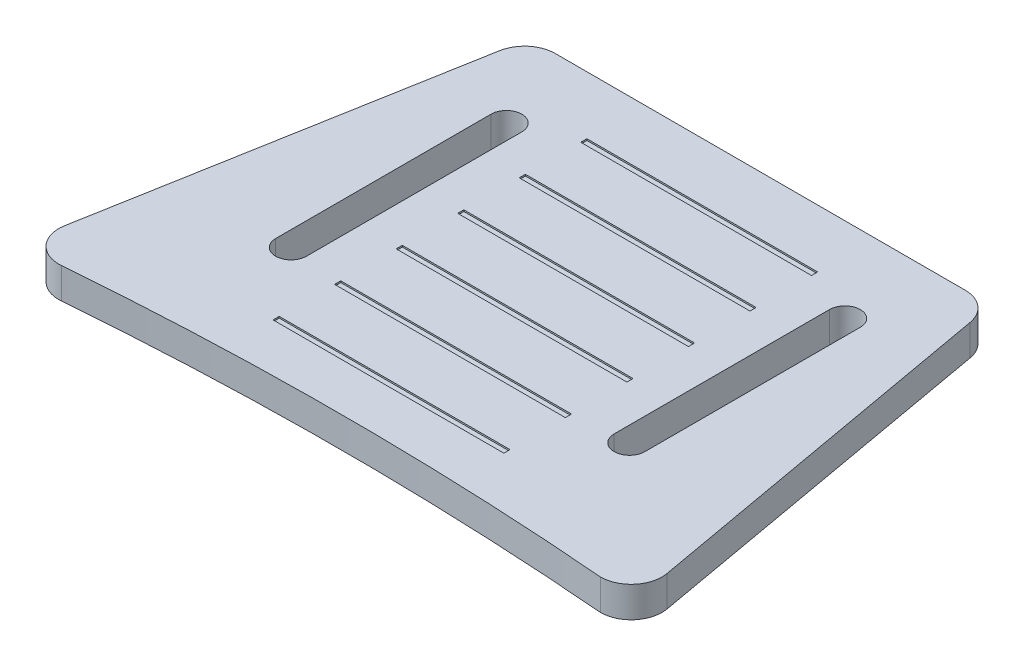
ISO-10303-21;
HEADER;
FILE_DESCRIPTION(('STEP AP214'),'2;1');
FILE_NAME('part.step','',(''),(''),'','','');
FILE_SCHEMA(('AUTOMOTIVE_DESIGN { 1 0 10303 214 1 1 1 1 }'));
ENDSEC;
DATA;
#1=APPLICATION_CONTEXT('core data for automotive mechanical design processes');
#2=APPLICATION_PROTOCOL_DEFINITION('international standard','automotive_design',2000,#1);
#3=PRODUCT_CONTEXT('',#1,'mechanical');
#4=PRODUCT('Part','Part','',(#3));
#5=PRODUCT_RELATED_PRODUCT_CATEGORY('part','',(#4));
#6=PRODUCT_DEFINITION_FORMATION('','',#4);
#7=PRODUCT_DEFINITION_CONTEXT('part definition',#1,'design');
#8=PRODUCT_DEFINITION('design','',#6,#7);
#9=PRODUCT_DEFINITION_SHAPE('','',#8);
#10=(LENGTH_UNIT() NAMED_UNIT(*) SI_UNIT(.MILLI.,.METRE.));
#11=(NAMED_UNIT(*) PLANE_ANGLE_UNIT() SI_UNIT($,.RADIAN.));
#12=(NAMED_UNIT(*) SI_UNIT($,.STERADIAN.) SOLID_ANGLE_UNIT());
#13=UNCERTAINTY_MEASURE_WITH_UNIT(LENGTH_MEASURE(1.E-05),#10,'distance_accuracy_value','');
#14=(GEOMETRIC_REPRESENTATION_CONTEXT(3) GLOBAL_UNCERTAINTY_ASSIGNED_CONTEXT((#13)) GLOBAL_UNIT_ASSIGNED_CONTEXT((#10,
#11,#12)) REPRESENTATION_CONTEXT('',''));
#15=CARTESIAN_POINT('',(0.,0.,0.));
#16=DIRECTION('',(0.,0.,1.));
#17=DIRECTION('',(1.,0.,0.));
#18=AXIS2_PLACEMENT_3D('',#15,#16,#17);
#19=CARTESIAN_POINT('',(32.6112196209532,2.,26.));
#20=DIRECTION('',(0.,-1.,0.));
#21=DIRECTION('',(0.,0.,-1.));
#22=AXIS2_PLACEMENT_3D('',#19,#20,#21);
#23=PLANE('',#22);
#24=DIRECTION('',(-1.,0.,0.));
#25=VECTOR('',#24,1.);
#26=CARTESIAN_POINT('',(7.5000000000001,2.,19.7696220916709));
#27=LINE('',#26,#25);
#28=CARTESIAN_POINT('',(22.5000000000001,2.,19.7696220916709));
#29=VERTEX_POINT('',#28);
#30=CARTESIAN_POINT('',(7.5000000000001,2.,19.7696220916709));
#31=VERTEX_POINT('',#30);
#32=EDGE_CURVE('E302',#29,#31,#27,.T.);
#33=ORIENTED_EDGE('',*,*,#32,.F.);
#34=DIRECTION('',(0.,0.,-1.));
#35=VECTOR('',#34,1.);
#36=CARTESIAN_POINT('',(22.5000000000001,2.,19.7696220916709));
#37=LINE('',#36,#35);
#38=CARTESIAN_POINT('',(22.5000000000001,2.,20.1696220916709));
#39=VERTEX_POINT('',#38);
#40=EDGE_CURVE('E316',#39,#29,#37,.T.);
#41=ORIENTED_EDGE('',*,*,#40,.F.);
#42=DIRECTION('',(1.,0.,0.));
#43=VECTOR('',#42,1.);
#44=CARTESIAN_POINT('',(7.5000000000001,2.,20.1696220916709));
#45=LINE('',#44,#43);
#46=CARTESIAN_POINT('',(7.5000000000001,2.,20.1696220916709));
#47=VERTEX_POINT('',#46);
#48=EDGE_CURVE('E326',#47,#39,#45,.T.);
#49=ORIENTED_EDGE('',*,*,#48,.F.);
#50=DIRECTION('',(0.,0.,1.));
#51=VECTOR('',#50,1.);
#52=CARTESIAN_POINT('',(7.5000000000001,2.,19.7696220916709));
#53=LINE('',#52,#51);
#54=EDGE_CURVE('E317',#31,#47,#53,.T.);
#55=ORIENTED_EDGE('',*,*,#54,.F.);
#56=EDGE_LOOP('',(#33,#41,#49,#55));
#57=FACE_BOUND('',#56,.T.);
#58=DIRECTION('',(-1.,0.,0.));
#59=VECTOR('',#58,1.);
#60=CARTESIAN_POINT('',(7.5000000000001,2.,23.7696220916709));
#61=LINE('',#60,#59);
#62=CARTESIAN_POINT('',(22.5000000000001,2.,23.7696220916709));
#63=VERTEX_POINT('',#62);
#64=CARTESIAN_POINT('',(7.5000000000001,2.,23.7696220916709));
#65=VERTEX_POINT('',#64);
#66=EDGE_CURVE('E347',#63,#65,#61,.T.);
#67=ORIENTED_EDGE('',*,*,#66,.F.);
#68=DIRECTION('',(0.,0.,-1.));
#69=VECTOR('',#68,1.);
#70=CARTESIAN_POINT('',(22.5000000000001,2.,23.7696220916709));
#71=LINE('',#70,#69);
#72=CARTESIAN_POINT('',(22.5000000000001,2.,24.1696220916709));
#73=VERTEX_POINT('',#72);
#74=EDGE_CURVE('E331',#73,#63,#71,.T.);
#75=ORIENTED_EDGE('',*,*,#74,.F.);
#76=DIRECTION('',(1.,0.,0.));
#77=VECTOR('',#76,1.);
#78=CARTESIAN_POINT('',(7.5000000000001,2.,24.1696220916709));
#79=LINE('',#78,#77);
#80=CARTESIAN_POINT('',(7.5000000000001,2.,24.1696220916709));
#81=VERTEX_POINT('',#80);
#82=EDGE_CURVE('E336',#81,#73,#79,.T.);
#83=ORIENTED_EDGE('',*,*,#82,.F.);
#84=DIRECTION('',(0.,0.,1.));
#85=VECTOR('',#84,1.);
#86=CARTESIAN_POINT('',(7.5000000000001,2.,23.7696220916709));
#87=LINE('',#86,#85);
#88=EDGE_CURVE('E350',#65,#81,#87,.T.);
#89=ORIENTED_EDGE('',*,*,#88,.F.);
#90=EDGE_LOOP('',(#67,#75,#83,#89));
#91=FACE_BOUND('',#90,.T.);
#92=CARTESIAN_POINT('',(4.,2.,5.5));
#93=DIRECTION('',(0.,1.,0.));
#94=DIRECTION('',(0.,0.,1.));
#95=AXIS2_PLACEMENT_3D('',#92,#93,#94);
#96=CIRCLE('',#95,1.);
#97=CARTESIAN_POINT('',(5.,2.,5.5));
#98=VERTEX_POINT('',#97);
#99=CARTESIAN_POINT('',(3.,2.,5.5));
#100=VERTEX_POINT('',#99);
#101=EDGE_CURVE('E395',#98,#100,#96,.T.);
#102=ORIENTED_EDGE('',*,*,#101,.F.);
#103=DIRECTION('',(0.,0.,-1.));
#104=VECTOR('',#103,1.);
#105=CARTESIAN_POINT('',(5.,2.,5.5));
#106=LINE('',#105,#104);
#107=CARTESIAN_POINT('',(5.,2.,19.5));
#108=VERTEX_POINT('',#107);
#109=EDGE_CURVE('E403',#108,#98,#106,.T.);
#110=ORIENTED_EDGE('',*,*,#109,.F.);
#111=CARTESIAN_POINT('',(4.,2.,19.5));
#112=DIRECTION('',(0.,1.,0.));
#113=DIRECTION('',(0.,0.,1.));
#114=AXIS2_PLACEMENT_3D('',#111,#112,#113);
#115=CIRCLE('',#114,0.999999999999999);
#116=CARTESIAN_POINT('',(3.,2.,19.5));
#117=VERTEX_POINT('',#116);
#118=EDGE_CURVE('E400',#117,#108,#115,.T.);
#119=ORIENTED_EDGE('',*,*,#118,.F.);
#120=DIRECTION('',(0.,0.,1.));
#121=VECTOR('',#120,1.);
#122=CARTESIAN_POINT('',(3.,2.,5.5));
#123=LINE('',#122,#121);
#124=EDGE_CURVE('E397',#100,#117,#123,.T.);
#125=ORIENTED_EDGE('',*,*,#124,.F.);
#126=EDGE_LOOP('',(#102,#110,#119,#125));
#127=FACE_BOUND('',#126,.T.);
#128=CARTESIAN_POINT('',(32.6112196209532,2.,26.));
#129=DIRECTION('',(0.,1.,0.));
#130=DIRECTION('',(0.,0.,-1.));
#131=AXIS2_PLACEMENT_3D('',#128,#129,#130);
#132=CIRCLE('',#131,2.00000000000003);
#133=CARTESIAN_POINT('',(32.6112196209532,2.,28.));
#134=VERTEX_POINT('',#133);
#135=CARTESIAN_POINT('',(34.5800747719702,2.,25.6484187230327));
#136=VERTEX_POINT('',#135);
#137=EDGE_CURVE('E426',#134,#136,#132,.T.);
#138=ORIENTED_EDGE('',*,*,#137,.T.);
#139=DIRECTION('',(-0.17579063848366,0.,-0.984427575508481));
#140=VECTOR('',#139,1.);
#141=CARTESIAN_POINT('',(30.2943604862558,2.,1.64841872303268));
#142=LINE('',#141,#140);
#143=CARTESIAN_POINT('',(30.2943604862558,2.,1.64841872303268));
#144=VERTEX_POINT('',#143);
#145=EDGE_CURVE('E429',#136,#144,#142,.T.);
#146=ORIENTED_EDGE('',*,*,#145,.T.);
#147=CARTESIAN_POINT('',(28.3255053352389,2.,2.));
#148=DIRECTION('',(0.,1.,0.));
#149=DIRECTION('',(0.,0.,-1.));
#150=AXIS2_PLACEMENT_3D('',#147,#148,#149);
#151=CIRCLE('',#150,2.);
#152=CARTESIAN_POINT('',(28.3255053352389,2.,0.));
#153=VERTEX_POINT('',#152);
#154=EDGE_CURVE('E432',#144,#153,#151,.T.);
#155=ORIENTED_EDGE('',*,*,#154,.T.);
#156=DIRECTION('',(-1.,0.,0.));
#157=VECTOR('',#156,1.);
#158=CARTESIAN_POINT('',(1.67449466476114,2.,0.));
#159=LINE('',#158,#157);
#160=CARTESIAN_POINT('',(1.67449466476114,2.,0.));
#161=VERTEX_POINT('',#160);
#162=EDGE_CURVE('E434',#153,#161,#159,.T.);
#163=ORIENTED_EDGE('',*,*,#162,.T.);
#164=CARTESIAN_POINT('',(1.67449466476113,2.,2.));
#165=DIRECTION('',(0.,1.,0.));
#166=DIRECTION('',(0.,0.,1.));
#167=AXIS2_PLACEMENT_3D('',#164,#165,#166);
#168=CIRCLE('',#167,2.);
#169=CARTESIAN_POINT('',(-0.294360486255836,2.,1.64841872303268));
#170=VERTEX_POINT('',#169);
#171=EDGE_CURVE('E436',#161,#170,#168,.T.);
#172=ORIENTED_EDGE('',*,*,#171,.T.);
#173=DIRECTION('',(-0.175790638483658,0.,0.984427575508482));
#174=VECTOR('',#173,1.);
#175=CARTESIAN_POINT('',(-4.57883865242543,2.,25.6414964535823));
#176=LINE('',#175,#174);
#177=CARTESIAN_POINT('',(-4.57883865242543,2.,25.6414964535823));
#178=VERTEX_POINT('',#177);
#179=EDGE_CURVE('E438',#170,#178,#176,.T.);
#180=ORIENTED_EDGE('',*,*,#179,.T.);
#181=CARTESIAN_POINT('',(-2.60998350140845,2.,25.9930777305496));
#182=DIRECTION('',(0.,1.,0.));
#183=DIRECTION('',(0.,0.,-1.));
#184=AXIS2_PLACEMENT_3D('',#181,#182,#183);
#185=CIRCLE('',#184,1.99999999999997);
#186=CARTESIAN_POINT('',(-2.44601134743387,2.,27.9863446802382));
#187=VERTEX_POINT('',#186);
#188=EDGE_CURVE('E440',#178,#187,#185,.T.);
#189=ORIENTED_EDGE('',*,*,#188,.T.);
#190=CARTESIAN_POINT('',(15.,2.,240.062340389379));
#191=DIRECTION('',(0.,-1.,0.));
#192=DIRECTION('',(0.,0.,-1.));
#193=AXIS2_PLACEMENT_3D('',#190,#191,#192);
#194=CIRCLE('',#193,212.792366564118);
#195=EDGE_CURVE('E442',#187,#134,#194,.T.);
#196=ORIENTED_EDGE('',*,*,#195,.T.);
#197=EDGE_LOOP('',(#138,#146,#155,#163,#172,#180,#189,#196));
#198=FACE_BOUND('',#197,.T.);
#199=CARTESIAN_POINT('',(26.,2.,5.5));
#200=DIRECTION('',(0.,1.,0.));
#201=DIRECTION('',(0.,0.,-1.));
#202=AXIS2_PLACEMENT_3D('',#199,#200,#201);
#203=CIRCLE('',#202,1.);
#204=CARTESIAN_POINT('',(27.,2.,5.5));
#205=VERTEX_POINT('',#204);
#206=CARTESIAN_POINT('',(25.,2.,5.5));
#207=VERTEX_POINT('',#206);
#208=EDGE_CURVE('E364',#205,#207,#203,.T.);
#209=ORIENTED_EDGE('',*,*,#208,.F.);
#210=DIRECTION('',(0.,0.,-1.));
#211=VECTOR('',#210,1.);
#212=CARTESIAN_POINT('',(27.,2.,5.5));
#213=LINE('',#212,#211);
#214=CARTESIAN_POINT('',(27.,2.,19.5));
#215=VERTEX_POINT('',#214);
#216=EDGE_CURVE('E372',#215,#205,#213,.T.);
#217=ORIENTED_EDGE('',*,*,#216,.F.);
#218=CARTESIAN_POINT('',(26.,2.,19.5));
#219=DIRECTION('',(0.,1.,0.));
#220=DIRECTION('',(0.,0.,-1.));
#221=AXIS2_PLACEMENT_3D('',#218,#219,#220);
#222=CIRCLE('',#221,0.999999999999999);
#223=CARTESIAN_POINT('',(25.,2.,19.5));
#224=VERTEX_POINT('',#223);
#225=EDGE_CURVE('E369',#224,#215,#222,.T.);
#226=ORIENTED_EDGE('',*,*,#225,.F.);
#227=DIRECTION('',(0.,0.,1.));
#228=VECTOR('',#227,1.);
#229=CARTESIAN_POINT('',(25.,2.,5.5));
#230=LINE('',#229,#228);
#231=EDGE_CURVE('E366',#207,#224,#230,.T.);
#232=ORIENTED_EDGE('',*,*,#231,.F.);
#233=EDGE_LOOP('',(#209,#217,#226,#232));
#234=FACE_BOUND('',#233,.T.);
#235=DIRECTION('',(0.,0.,-1.));
#236=VECTOR('',#235,1.);
#237=CARTESIAN_POINT('',(22.5000000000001,2.,15.7696220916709));
#238=LINE('',#237,#236);
#239=CARTESIAN_POINT('',(22.5000000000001,2.,16.1696220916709));
#240=VERTEX_POINT('',#239);
#241=CARTESIAN_POINT('',(22.5000000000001,2.,15.7696220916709));
#242=VERTEX_POINT('',#241);
#243=EDGE_CURVE('E483',#240,#242,#238,.T.);
#244=ORIENTED_EDGE('',*,*,#243,.F.);
#245=DIRECTION('',(1.,0.,0.));
#246=VECTOR('',#245,1.);
#247=CARTESIAN_POINT('',(7.5000000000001,2.,16.1696220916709));
#248=LINE('',#247,#246);
#249=CARTESIAN_POINT('',(7.5000000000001,2.,16.1696220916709));
#250=VERTEX_POINT('',#249);
#251=EDGE_CURVE('E485',#250,#240,#248,.T.);
#252=ORIENTED_EDGE('',*,*,#251,.F.);
#253=DIRECTION('',(0.,0.,1.));
#254=VECTOR('',#253,1.);
#255=CARTESIAN_POINT('',(7.5000000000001,2.,15.7696220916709));
#256=LINE('',#255,#254);
#257=CARTESIAN_POINT('',(7.5000000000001,2.,15.7696220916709));
#258=VERTEX_POINT('',#257);
#259=EDGE_CURVE('E488',#258,#250,#256,.T.);
#260=ORIENTED_EDGE('',*,*,#259,.F.);
#261=DIRECTION('',(-1.,0.,0.));
#262=VECTOR('',#261,1.);
#263=CARTESIAN_POINT('',(7.5000000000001,2.,15.7696220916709));
#264=LINE('',#263,#262);
#265=EDGE_CURVE('E491',#242,#258,#264,.T.);
#266=ORIENTED_EDGE('',*,*,#265,.F.);
#267=EDGE_LOOP('',(#244,#252,#260,#266));
#268=FACE_BOUND('',#267,.T.);
#269=DIRECTION('',(0.,0.,-1.));
#270=VECTOR('',#269,1.);
#271=CARTESIAN_POINT('',(22.5000000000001,2.,11.7696220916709));
#272=LINE('',#271,#270);
#273=CARTESIAN_POINT('',(22.5000000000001,2.,12.1696220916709));
#274=VERTEX_POINT('',#273);
#275=CARTESIAN_POINT('',(22.5000000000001,2.,11.7696220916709));
#276=VERTEX_POINT('',#275);
#277=EDGE_CURVE('E518',#274,#276,#272,.T.);
#278=ORIENTED_EDGE('',*,*,#277,.F.);
#279=DIRECTION('',(1.,0.,0.));
#280=VECTOR('',#279,1.);
#281=CARTESIAN_POINT('',(7.5000000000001,2.,12.1696220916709));
#282=LINE('',#281,#280);
#283=CARTESIAN_POINT('',(7.5000000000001,2.,12.1696220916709));
#284=VERTEX_POINT('',#283);
#285=EDGE_CURVE('E520',#284,#274,#282,.T.);
#286=ORIENTED_EDGE('',*,*,#285,.F.);
#287=DIRECTION('',(0.,0.,1.));
#288=VECTOR('',#287,1.);
#289=CARTESIAN_POINT('',(7.5000000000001,2.,11.7696220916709));
#290=LINE('',#289,#288);
#291=CARTESIAN_POINT('',(7.5000000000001,2.,11.7696220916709));
#292=VERTEX_POINT('',#291);
#293=EDGE_CURVE('E523',#292,#284,#290,.T.);
#294=ORIENTED_EDGE('',*,*,#293,.F.);
#295=DIRECTION('',(-1.,0.,0.));
#296=VECTOR('',#295,1.);
#297=CARTESIAN_POINT('',(7.5000000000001,2.,11.7696220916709));
#298=LINE('',#297,#296);
#299=EDGE_CURVE('E526',#276,#292,#298,.T.);
#300=ORIENTED_EDGE('',*,*,#299,.F.);
#301=EDGE_LOOP('',(#278,#286,#294,#300));
#302=FACE_BOUND('',#301,.T.);
#303=DIRECTION('',(0.,0.,-1.));
#304=VECTOR('',#303,1.);
#305=CARTESIAN_POINT('',(22.5000000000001,2.,7.76962209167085));
#306=LINE('',#305,#304);
#307=CARTESIAN_POINT('',(22.5000000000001,2.,8.16962209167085));
#308=VERTEX_POINT('',#307);
#309=CARTESIAN_POINT('',(22.5000000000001,2.,7.76962209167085));
#310=VERTEX_POINT('',#309);
#311=EDGE_CURVE('E553',#308,#310,#306,.T.);
#312=ORIENTED_EDGE('',*,*,#311,.F.);
#313=DIRECTION('',(1.,0.,0.));
#314=VECTOR('',#313,1.);
#315=CARTESIAN_POINT('',(7.5000000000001,2.,8.16962209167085));
#316=LINE('',#315,#314);
#317=CARTESIAN_POINT('',(7.5000000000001,2.,8.16962209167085));
#318=VERTEX_POINT('',#317);
#319=EDGE_CURVE('E555',#318,#308,#316,.T.);
#320=ORIENTED_EDGE('',*,*,#319,.F.);
#321=DIRECTION('',(0.,0.,1.));
#322=VECTOR('',#321,1.);
#323=CARTESIAN_POINT('',(7.5000000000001,2.,7.76962209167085));
#324=LINE('',#323,#322);
#325=CARTESIAN_POINT('',(7.5000000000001,2.,7.76962209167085));
#326=VERTEX_POINT('',#325);
#327=EDGE_CURVE('E558',#326,#318,#324,.T.);
#328=ORIENTED_EDGE('',*,*,#327,.F.);
#329=DIRECTION('',(-1.,0.,0.));
#330=VECTOR('',#329,1.);
#331=CARTESIAN_POINT('',(7.5000000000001,2.,7.76962209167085));
#332=LINE('',#331,#330);
#333=EDGE_CURVE('E561',#310,#326,#332,.T.);
#334=ORIENTED_EDGE('',*,*,#333,.F.);
#335=EDGE_LOOP('',(#312,#320,#328,#334));
#336=FACE_BOUND('',#335,.T.);
#337=DIRECTION('',(0.,0.,-1.));
#338=VECTOR('',#337,1.);
#339=CARTESIAN_POINT('',(22.5000000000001,2.,3.76962209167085));
#340=LINE('',#339,#338);
#341=CARTESIAN_POINT('',(22.5000000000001,2.,4.16962209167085));
#342=VERTEX_POINT('',#341);
#343=CARTESIAN_POINT('',(22.5000000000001,2.,3.76962209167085));
#344=VERTEX_POINT('',#343);
#345=EDGE_CURVE('E588',#342,#344,#340,.T.);
#346=ORIENTED_EDGE('',*,*,#345,.F.);
#347=DIRECTION('',(1.,0.,0.));
#348=VECTOR('',#347,1.);
#349=CARTESIAN_POINT('',(7.5000000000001,2.,4.16962209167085));
#350=LINE('',#349,#348);
#351=CARTESIAN_POINT('',(7.5000000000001,2.,4.16962209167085));
#352=VERTEX_POINT('',#351);
#353=EDGE_CURVE('E590',#352,#342,#350,.T.);
#354=ORIENTED_EDGE('',*,*,#353,.F.);
#355=DIRECTION('',(0.,0.,1.));
#356=VECTOR('',#355,1.);
#357=CARTESIAN_POINT('',(7.5000000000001,2.,3.76962209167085));
#358=LINE('',#357,#356);
#359=CARTESIAN_POINT('',(7.5000000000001,2.,3.76962209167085));
#360=VERTEX_POINT('',#359);
#361=EDGE_CURVE('E593',#360,#352,#358,.T.);
#362=ORIENTED_EDGE('',*,*,#361,.F.);
#363=DIRECTION('',(-1.,0.,0.));
#364=VECTOR('',#363,1.);
#365=CARTESIAN_POINT('',(7.5000000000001,2.,3.76962209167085));
#366=LINE('',#365,#364);
#367=EDGE_CURVE('E596',#344,#360,#366,.T.);
#368=ORIENTED_EDGE('',*,*,#367,.F.);
#369=EDGE_LOOP('',(#346,#354,#362,#368));
#370=FACE_BOUND('',#369,.T.);
#371=ADVANCED_FACE('F32',(#57,#91,#127,#198,#234,#268,#302,#336,#370),#23,.F.);
#372=CARTESIAN_POINT('',(32.6112196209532,0.,26.));
#373=DIRECTION('',(0.,-1.,0.));
#374=DIRECTION('',(0.,0.,-1.));
#375=AXIS2_PLACEMENT_3D('',#372,#373,#374);
#376=PLANE('',#375);
#377=DIRECTION('',(0.,0.,-1.));
#378=VECTOR('',#377,1.);
#379=CARTESIAN_POINT('',(5.,0.,5.5));
#380=LINE('',#379,#378);
#381=CARTESIAN_POINT('',(5.,0.,19.5));
#382=VERTEX_POINT('',#381);
#383=CARTESIAN_POINT('',(5.00000000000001,0.,5.5));
#384=VERTEX_POINT('',#383);
#385=EDGE_CURVE('E398',#382,#384,#380,.T.);
#386=ORIENTED_EDGE('',*,*,#385,.T.);
#387=CARTESIAN_POINT('',(4.,0.,5.5));
#388=DIRECTION('',(0.,1.,0.));
#389=DIRECTION('',(0.,0.,1.));
#390=AXIS2_PLACEMENT_3D('',#387,#388,#389);
#391=CIRCLE('',#390,1.);
#392=CARTESIAN_POINT('',(3.,0.,5.5));
#393=VERTEX_POINT('',#392);
#394=EDGE_CURVE('E394',#384,#393,#391,.T.);
#395=ORIENTED_EDGE('',*,*,#394,.T.);
#396=DIRECTION('',(0.,0.,1.));
#397=VECTOR('',#396,1.);
#398=CARTESIAN_POINT('',(3.,0.,5.5));
#399=LINE('',#398,#397);
#400=CARTESIAN_POINT('',(3.,0.,19.5));
#401=VERTEX_POINT('',#400);
#402=EDGE_CURVE('E408',#393,#401,#399,.T.);
#403=ORIENTED_EDGE('',*,*,#402,.T.);
#404=CARTESIAN_POINT('',(4.,0.,19.5));
#405=DIRECTION('',(0.,1.,0.));
#406=DIRECTION('',(0.,0.,1.));
#407=AXIS2_PLACEMENT_3D('',#404,#405,#406);
#408=CIRCLE('',#407,0.999999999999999);
#409=EDGE_CURVE('E411',#401,#382,#408,.T.);
#410=ORIENTED_EDGE('',*,*,#409,.T.);
#411=EDGE_LOOP('',(#386,#395,#403,#410));
#412=FACE_BOUND('',#411,.T.);
#413=CARTESIAN_POINT('',(32.6112196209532,0.,26.));
#414=DIRECTION('',(0.,1.,0.));
#415=DIRECTION('',(0.,0.,-1.));
#416=AXIS2_PLACEMENT_3D('',#413,#414,#415);
#417=CIRCLE('',#416,2.00000000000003);
#418=CARTESIAN_POINT('',(32.6112196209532,0.,28.));
#419=VERTEX_POINT('',#418);
#420=CARTESIAN_POINT('',(34.5800747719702,0.,25.6484187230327));
#421=VERTEX_POINT('',#420);
#422=EDGE_CURVE('E425',#419,#421,#417,.T.);
#423=ORIENTED_EDGE('',*,*,#422,.F.);
#424=CARTESIAN_POINT('',(15.,0.,240.062340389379));
#425=DIRECTION('',(0.,-1.,0.));
#426=DIRECTION('',(0.,0.,-1.));
#427=AXIS2_PLACEMENT_3D('',#424,#425,#426);
#428=CIRCLE('',#427,212.792366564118);
#429=CARTESIAN_POINT('',(-2.44601134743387,0.,27.9863446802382));
#430=VERTEX_POINT('',#429);
#431=EDGE_CURVE('E430',#430,#419,#428,.T.);
#432=ORIENTED_EDGE('',*,*,#431,.F.);
#433=CARTESIAN_POINT('',(-2.60998350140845,0.,25.9930777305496));
#434=DIRECTION('',(0.,1.,0.));
#435=DIRECTION('',(0.,0.,-1.));
#436=AXIS2_PLACEMENT_3D('',#433,#434,#435);
#437=CIRCLE('',#436,1.99999999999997);
#438=CARTESIAN_POINT('',(-4.57883865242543,0.,25.6414964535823));
#439=VERTEX_POINT('',#438);
#440=EDGE_CURVE('E457',#439,#430,#437,.T.);
#441=ORIENTED_EDGE('',*,*,#440,.F.);
#442=DIRECTION('',(-0.175790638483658,0.,0.984427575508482));
#443=VECTOR('',#442,1.);
#444=CARTESIAN_POINT('',(-4.57883865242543,0.,25.6414964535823));
#445=LINE('',#444,#443);
#446=CARTESIAN_POINT('',(-0.294360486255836,0.,1.64841872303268));
#447=VERTEX_POINT('',#446);
#448=EDGE_CURVE('E455',#447,#439,#445,.T.);
#449=ORIENTED_EDGE('',*,*,#448,.F.);
#450=CARTESIAN_POINT('',(1.67449466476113,0.,2.));
#451=DIRECTION('',(0.,1.,0.));
#452=DIRECTION('',(0.,0.,1.));
#453=AXIS2_PLACEMENT_3D('',#450,#451,#452);
#454=CIRCLE('',#453,2.);
#455=CARTESIAN_POINT('',(1.67449466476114,0.,0.));
#456=VERTEX_POINT('',#455);
#457=EDGE_CURVE('E453',#456,#447,#454,.T.);
#458=ORIENTED_EDGE('',*,*,#457,.F.);
#459=DIRECTION('',(-1.,0.,0.));
#460=VECTOR('',#459,1.);
#461=CARTESIAN_POINT('',(1.67449466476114,0.,0.));
#462=LINE('',#461,#460);
#463=CARTESIAN_POINT('',(28.3255053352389,0.,0.));
#464=VERTEX_POINT('',#463);
#465=EDGE_CURVE('E451',#464,#456,#462,.T.);
#466=ORIENTED_EDGE('',*,*,#465,.F.);
#467=CARTESIAN_POINT('',(28.3255053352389,0.,2.));
#468=DIRECTION('',(0.,1.,0.));
#469=DIRECTION('',(0.,0.,-1.));
#470=AXIS2_PLACEMENT_3D('',#467,#468,#469);
#471=CIRCLE('',#470,2.);
#472=CARTESIAN_POINT('',(30.2943604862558,0.,1.64841872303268));
#473=VERTEX_POINT('',#472);
#474=EDGE_CURVE('E449',#473,#464,#471,.T.);
#475=ORIENTED_EDGE('',*,*,#474,.F.);
#476=DIRECTION('',(-0.17579063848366,0.,-0.984427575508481));
#477=VECTOR('',#476,1.);
#478=CARTESIAN_POINT('',(30.2943604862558,0.,1.64841872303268));
#479=LINE('',#478,#477);
#480=EDGE_CURVE('E447',#421,#473,#479,.T.);
#481=ORIENTED_EDGE('',*,*,#480,.F.);
#482=EDGE_LOOP('',(#423,#432,#441,#449,#458,#466,#475,#481));
#483=FACE_BOUND('',#482,.T.);
#484=DIRECTION('',(0.,0.,-1.));
#485=VECTOR('',#484,1.);
#486=CARTESIAN_POINT('',(27.,0.,5.5));
#487=LINE('',#486,#485);
#488=CARTESIAN_POINT('',(27.,0.,19.5));
#489=VERTEX_POINT('',#488);
#490=CARTESIAN_POINT('',(27.,0.,5.5));
#491=VERTEX_POINT('',#490);
#492=EDGE_CURVE('E367',#489,#491,#487,.T.);
#493=ORIENTED_EDGE('',*,*,#492,.T.);
#494=CARTESIAN_POINT('',(26.,0.,5.5));
#495=DIRECTION('',(0.,1.,0.));
#496=DIRECTION('',(0.,0.,-1.));
#497=AXIS2_PLACEMENT_3D('',#494,#495,#496);
#498=CIRCLE('',#497,1.);
#499=CARTESIAN_POINT('',(25.,0.,5.5));
#500=VERTEX_POINT('',#499);
#501=EDGE_CURVE('E357',#491,#500,#498,.T.);
#502=ORIENTED_EDGE('',*,*,#501,.T.);
#503=DIRECTION('',(0.,0.,1.));
#504=VECTOR('',#503,1.);
#505=CARTESIAN_POINT('',(25.,0.,5.5));
#506=LINE('',#505,#504);
#507=CARTESIAN_POINT('',(25.,0.,19.5));
#508=VERTEX_POINT('',#507);
#509=EDGE_CURVE('E377',#500,#508,#506,.T.);
#510=ORIENTED_EDGE('',*,*,#509,.T.);
#511=CARTESIAN_POINT('',(26.,0.,19.5));
#512=DIRECTION('',(0.,1.,0.));
#513=DIRECTION('',(0.,0.,-1.));
#514=AXIS2_PLACEMENT_3D('',#511,#512,#513);
#515=CIRCLE('',#514,0.999999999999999);
#516=EDGE_CURVE('E380',#508,#489,#515,.T.);
#517=ORIENTED_EDGE('',*,*,#516,.T.);
#518=EDGE_LOOP('',(#493,#502,#510,#517));
#519=FACE_BOUND('',#518,.T.);
#520=ADVANCED_FACE('F622',(#412,#483,#519),#376,.T.);
#521=CARTESIAN_POINT('',(32.6112196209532,2.,26.));
#522=DIRECTION('',(0.,-1.,0.));
#523=DIRECTION('',(0.,0.,-1.));
#524=AXIS2_PLACEMENT_3D('',#521,#522,#523);
#525=CYLINDRICAL_SURFACE('',#524,2.00000000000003);
#526=ORIENTED_EDGE('',*,*,#422,.T.);
#527=DIRECTION('',(0.,-1.,0.));
#528=VECTOR('',#527,1.);
#529=CARTESIAN_POINT('',(34.5800747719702,2.,25.6484187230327));
#530=LINE('',#529,#528);
#531=EDGE_CURVE('E480',#136,#421,#530,.T.);
#532=ORIENTED_EDGE('',*,*,#531,.F.);
#533=ORIENTED_EDGE('',*,*,#137,.F.);
#534=DIRECTION('',(0.,-1.,0.));
#535=VECTOR('',#534,1.);
#536=CARTESIAN_POINT('',(32.6112196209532,2.,28.));
#537=LINE('',#536,#535);
#538=EDGE_CURVE('E444',#134,#419,#537,.T.);
#539=ORIENTED_EDGE('',*,*,#538,.T.);
#540=EDGE_LOOP('',(#526,#532,#533,#539));
#541=FACE_BOUND('',#540,.T.);
#542=ADVANCED_FACE('F628',(#541),#525,.T.);
#543=CARTESIAN_POINT('',(30.2943604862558,2.,1.64841872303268));
#544=DIRECTION('',(-0.984427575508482,0.,0.17579063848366));
#545=DIRECTION('',(0.17579063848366,0.,0.984427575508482));
#546=AXIS2_PLACEMENT_3D('',#543,#544,#545);
#547=PLANE('',#546);
#548=ORIENTED_EDGE('',*,*,#480,.T.);
#549=DIRECTION('',(0.,-1.,0.));
#550=VECTOR('',#549,1.);
#551=CARTESIAN_POINT('',(30.2943604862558,2.,1.64841872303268));
#552=LINE('',#551,#550);
#553=EDGE_CURVE('E477',#144,#473,#552,.T.);
#554=ORIENTED_EDGE('',*,*,#553,.F.);
#555=ORIENTED_EDGE('',*,*,#145,.F.);
#556=ORIENTED_EDGE('',*,*,#531,.T.);
#557=EDGE_LOOP('',(#548,#554,#555,#556));
#558=FACE_BOUND('',#557,.T.);
#559=ADVANCED_FACE('F659',(#558),#547,.F.);
#560=CARTESIAN_POINT('',(28.3255053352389,2.,2.));
#561=DIRECTION('',(0.,-1.,0.));
#562=DIRECTION('',(0.,0.,-1.));
#563=AXIS2_PLACEMENT_3D('',#560,#561,#562);
#564=CYLINDRICAL_SURFACE('',#563,2.);
#565=ORIENTED_EDGE('',*,*,#474,.T.);
#566=DIRECTION('',(0.,-1.,0.));
#567=VECTOR('',#566,1.);
#568=CARTESIAN_POINT('',(28.3255053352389,2.,0.));
#569=LINE('',#568,#567);
#570=EDGE_CURVE('E474',#153,#464,#569,.T.);
#571=ORIENTED_EDGE('',*,*,#570,.F.);
#572=ORIENTED_EDGE('',*,*,#154,.F.);
#573=ORIENTED_EDGE('',*,*,#553,.T.);
#574=EDGE_LOOP('',(#565,#571,#572,#573));
#575=FACE_BOUND('',#574,.T.);
#576=ADVANCED_FACE('F655',(#575),#564,.T.);
#577=CARTESIAN_POINT('',(1.67449466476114,2.,0.));
#578=DIRECTION('',(0.,0.,1.));
#579=DIRECTION('',(1.,0.,0.));
#580=AXIS2_PLACEMENT_3D('',#577,#578,#579);
#581=PLANE('',#580);
#582=ORIENTED_EDGE('',*,*,#465,.T.);
#583=DIRECTION('',(0.,-1.,0.));
#584=VECTOR('',#583,1.);
#585=CARTESIAN_POINT('',(1.67449466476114,2.,0.));
#586=LINE('',#585,#584);
#587=EDGE_CURVE('E471',#161,#456,#586,.T.);
#588=ORIENTED_EDGE('',*,*,#587,.F.);
#589=ORIENTED_EDGE('',*,*,#162,.F.);
#590=ORIENTED_EDGE('',*,*,#570,.T.);
#591=EDGE_LOOP('',(#582,#588,#589,#590));
#592=FACE_BOUND('',#591,.T.);
#593=ADVANCED_FACE('F651',(#592),#581,.F.);
#594=CARTESIAN_POINT('',(1.67449466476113,2.,2.));
#595=DIRECTION('',(0.,-1.,0.));
#596=DIRECTION('',(0.,0.,-1.));
#597=AXIS2_PLACEMENT_3D('',#594,#595,#596);
#598=CYLINDRICAL_SURFACE('',#597,2.);
#599=ORIENTED_EDGE('',*,*,#457,.T.);
#600=DIRECTION('',(0.,-1.,0.));
#601=VECTOR('',#600,1.);
#602=CARTESIAN_POINT('',(-0.294360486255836,2.,1.64841872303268));
#603=LINE('',#602,#601);
#604=EDGE_CURVE('E468',#170,#447,#603,.T.);
#605=ORIENTED_EDGE('',*,*,#604,.F.);
#606=ORIENTED_EDGE('',*,*,#171,.F.);
#607=ORIENTED_EDGE('',*,*,#587,.T.);
#608=EDGE_LOOP('',(#599,#605,#606,#607));
#609=FACE_BOUND('',#608,.T.);
#610=ADVANCED_FACE('F647',(#609),#598,.T.);
#611=CARTESIAN_POINT('',(-4.57883865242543,2.,25.6414964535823));
#612=DIRECTION('',(0.984427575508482,0.,0.175790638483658));
#613=DIRECTION('',(0.175790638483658,0.,-0.984427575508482));
#614=AXIS2_PLACEMENT_3D('',#611,#612,#613);
#615=PLANE('',#614);
#616=ORIENTED_EDGE('',*,*,#448,.T.);
#617=DIRECTION('',(0.,-1.,0.));
#618=VECTOR('',#617,1.);
#619=CARTESIAN_POINT('',(-4.57883865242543,2.,25.6414964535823));
#620=LINE('',#619,#618);
#621=EDGE_CURVE('E465',#178,#439,#620,.T.);
#622=ORIENTED_EDGE('',*,*,#621,.F.);
#623=ORIENTED_EDGE('',*,*,#179,.F.);
#624=ORIENTED_EDGE('',*,*,#604,.T.);
#625=EDGE_LOOP('',(#616,#622,#623,#624));
#626=FACE_BOUND('',#625,.T.);
#627=ADVANCED_FACE('F643',(#626),#615,.F.);
#628=CARTESIAN_POINT('',(-2.60998350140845,2.,25.9930777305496));
#629=DIRECTION('',(0.,-1.,0.));
#630=DIRECTION('',(0.,0.,-1.));
#631=AXIS2_PLACEMENT_3D('',#628,#629,#630);
#632=CYLINDRICAL_SURFACE('',#631,1.99999999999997);
#633=ORIENTED_EDGE('',*,*,#440,.T.);
#634=DIRECTION('',(0.,-1.,0.));
#635=VECTOR('',#634,1.);
#636=CARTESIAN_POINT('',(-2.44601134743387,2.,27.9863446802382));
#637=LINE('',#636,#635);
#638=EDGE_CURVE('E462',#187,#430,#637,.T.);
#639=ORIENTED_EDGE('',*,*,#638,.F.);
#640=ORIENTED_EDGE('',*,*,#188,.F.);
#641=ORIENTED_EDGE('',*,*,#621,.T.);
#642=EDGE_LOOP('',(#633,#639,#640,#641));
#643=FACE_BOUND('',#642,.T.);
#644=ADVANCED_FACE('F639',(#643),#632,.T.);
#645=CARTESIAN_POINT('',(15.,2.,240.062340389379));
#646=DIRECTION('',(0.,-1.,0.));
#647=DIRECTION('',(0.,0.,-1.));
#648=AXIS2_PLACEMENT_3D('',#645,#646,#647);
#649=CYLINDRICAL_SURFACE('',#648,212.792366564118);
#650=ORIENTED_EDGE('',*,*,#431,.T.);
#651=ORIENTED_EDGE('',*,*,#538,.F.);
#652=ORIENTED_EDGE('',*,*,#195,.F.);
#653=ORIENTED_EDGE('',*,*,#638,.T.);
#654=EDGE_LOOP('',(#650,#651,#652,#653));
#655=FACE_BOUND('',#654,.T.);
#656=ADVANCED_FACE('F636',(#655),#649,.F.);
#657=CARTESIAN_POINT('',(4.,2.,5.5));
#658=DIRECTION('',(0.,-1.,0.));
#659=DIRECTION('',(0.,0.,-1.));
#660=AXIS2_PLACEMENT_3D('',#657,#658,#659);
#661=CYLINDRICAL_SURFACE('',#660,1.);
#662=ORIENTED_EDGE('',*,*,#394,.F.);
#663=DIRECTION('',(0.,-1.,0.));
#664=VECTOR('',#663,1.);
#665=CARTESIAN_POINT('',(5.,2.,5.5));
#666=LINE('',#665,#664);
#667=EDGE_CURVE('E405',#98,#384,#666,.T.);
#668=ORIENTED_EDGE('',*,*,#667,.F.);
#669=ORIENTED_EDGE('',*,*,#101,.T.);
#670=DIRECTION('',(0.,-1.,0.));
#671=VECTOR('',#670,1.);
#672=CARTESIAN_POINT('',(3.,2.,5.5));
#673=LINE('',#672,#671);
#674=EDGE_CURVE('E422',#100,#393,#673,.T.);
#675=ORIENTED_EDGE('',*,*,#674,.T.);
#676=EDGE_LOOP('',(#662,#668,#669,#675));
#677=FACE_BOUND('',#676,.T.);
#678=ADVANCED_FACE('F633',(#677),#661,.F.);
#679=CARTESIAN_POINT('',(3.,2.,5.5));
#680=DIRECTION('',(1.,0.,0.));
#681=DIRECTION('',(0.,0.,-1.));
#682=AXIS2_PLACEMENT_3D('',#679,#680,#681);
#683=PLANE('',#682);
#684=ORIENTED_EDGE('',*,*,#402,.F.);
#685=ORIENTED_EDGE('',*,*,#674,.F.);
#686=ORIENTED_EDGE('',*,*,#124,.T.);
#687=DIRECTION('',(0.,-1.,0.));
#688=VECTOR('',#687,1.);
#689=CARTESIAN_POINT('',(3.,2.,19.5));
#690=LINE('',#689,#688);
#691=EDGE_CURVE('E420',#117,#401,#690,.T.);
#692=ORIENTED_EDGE('',*,*,#691,.T.);
#693=EDGE_LOOP('',(#684,#685,#686,#692));
#694=FACE_BOUND('',#693,.T.);
#695=ADVANCED_FACE('F919',(#694),#683,.T.);
#696=CARTESIAN_POINT('',(4.,2.,19.5));
#697=DIRECTION('',(0.,-1.,0.));
#698=DIRECTION('',(0.,0.,-1.));
#699=AXIS2_PLACEMENT_3D('',#696,#697,#698);
#700=CYLINDRICAL_SURFACE('',#699,0.999999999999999);
#701=ORIENTED_EDGE('',*,*,#409,.F.);
#702=ORIENTED_EDGE('',*,*,#691,.F.);
#703=ORIENTED_EDGE('',*,*,#118,.T.);
#704=DIRECTION('',(0.,-1.,0.));
#705=VECTOR('',#704,1.);
#706=CARTESIAN_POINT('',(5.,2.,19.5));
#707=LINE('',#706,#705);
#708=EDGE_CURVE('E418',#108,#382,#707,.T.);
#709=ORIENTED_EDGE('',*,*,#708,.T.);
#710=EDGE_LOOP('',(#701,#702,#703,#709));
#711=FACE_BOUND('',#710,.T.);
#712=ADVANCED_FACE('F911',(#711),#700,.F.);
#713=CARTESIAN_POINT('',(5.,2.,5.5));
#714=DIRECTION('',(-1.,0.,0.));
#715=DIRECTION('',(0.,0.,1.));
#716=AXIS2_PLACEMENT_3D('',#713,#714,#715);
#717=PLANE('',#716);
#718=ORIENTED_EDGE('',*,*,#385,.F.);
#719=ORIENTED_EDGE('',*,*,#708,.F.);
#720=ORIENTED_EDGE('',*,*,#109,.T.);
#721=ORIENTED_EDGE('',*,*,#667,.T.);
#722=EDGE_LOOP('',(#718,#719,#720,#721));
#723=FACE_BOUND('',#722,.T.);
#724=ADVANCED_FACE('F903',(#723),#717,.T.);
#725=CARTESIAN_POINT('',(26.,2.,5.5));
#726=DIRECTION('',(0.,-1.,0.));
#727=DIRECTION('',(0.,0.,-1.));
#728=AXIS2_PLACEMENT_3D('',#725,#726,#727);
#729=CYLINDRICAL_SURFACE('',#728,1.);
#730=ORIENTED_EDGE('',*,*,#501,.F.);
#731=DIRECTION('',(0.,-1.,0.));
#732=VECTOR('',#731,1.);
#733=CARTESIAN_POINT('',(27.,2.,5.5));
#734=LINE('',#733,#732);
#735=EDGE_CURVE('E374',#205,#491,#734,.T.);
#736=ORIENTED_EDGE('',*,*,#735,.F.);
#737=ORIENTED_EDGE('',*,*,#208,.T.);
#738=DIRECTION('',(0.,-1.,0.));
#739=VECTOR('',#738,1.);
#740=CARTESIAN_POINT('',(25.,2.,5.5));
#741=LINE('',#740,#739);
#742=EDGE_CURVE('E391',#207,#500,#741,.T.);
#743=ORIENTED_EDGE('',*,*,#742,.T.);
#744=EDGE_LOOP('',(#730,#736,#737,#743));
#745=FACE_BOUND('',#744,.T.);
#746=ADVANCED_FACE('F895',(#745),#729,.F.);
#747=CARTESIAN_POINT('',(25.,2.,5.5));
#748=DIRECTION('',(1.,0.,0.));
#749=DIRECTION('',(0.,0.,-1.));
#750=AXIS2_PLACEMENT_3D('',#747,#748,#749);
#751=PLANE('',#750);
#752=ORIENTED_EDGE('',*,*,#509,.F.);
#753=ORIENTED_EDGE('',*,*,#742,.F.);
#754=ORIENTED_EDGE('',*,*,#231,.T.);
#755=DIRECTION('',(0.,-1.,0.));
#756=VECTOR('',#755,1.);
#757=CARTESIAN_POINT('',(25.,2.,19.5));
#758=LINE('',#757,#756);
#759=EDGE_CURVE('E389',#224,#508,#758,.T.);
#760=ORIENTED_EDGE('',*,*,#759,.T.);
#761=EDGE_LOOP('',(#752,#753,#754,#760));
#762=FACE_BOUND('',#761,.T.);
#763=ADVANCED_FACE('F887',(#762),#751,.T.);
#764=CARTESIAN_POINT('',(26.,2.,19.5));
#765=DIRECTION('',(0.,-1.,0.));
#766=DIRECTION('',(0.,0.,-1.));
#767=AXIS2_PLACEMENT_3D('',#764,#765,#766);
#768=CYLINDRICAL_SURFACE('',#767,0.999999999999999);
#769=ORIENTED_EDGE('',*,*,#516,.F.);
#770=ORIENTED_EDGE('',*,*,#759,.F.);
#771=ORIENTED_EDGE('',*,*,#225,.T.);
#772=DIRECTION('',(0.,-1.,0.));
#773=VECTOR('',#772,1.);
#774=CARTESIAN_POINT('',(27.,2.,19.5));
#775=LINE('',#774,#773);
#776=EDGE_CURVE('E387',#215,#489,#775,.T.);
#777=ORIENTED_EDGE('',*,*,#776,.T.);
#778=EDGE_LOOP('',(#769,#770,#771,#777));
#779=FACE_BOUND('',#778,.T.);
#780=ADVANCED_FACE('F879',(#779),#768,.F.);
#781=CARTESIAN_POINT('',(27.,2.,5.5));
#782=DIRECTION('',(-1.,0.,0.));
#783=DIRECTION('',(0.,0.,1.));
#784=AXIS2_PLACEMENT_3D('',#781,#782,#783);
#785=PLANE('',#784);
#786=ORIENTED_EDGE('',*,*,#492,.F.);
#787=ORIENTED_EDGE('',*,*,#776,.F.);
#788=ORIENTED_EDGE('',*,*,#216,.T.);
#789=ORIENTED_EDGE('',*,*,#735,.T.);
#790=EDGE_LOOP('',(#786,#787,#788,#789));
#791=FACE_BOUND('',#790,.T.);
#792=ADVANCED_FACE('F871',(#791),#785,.T.);
#793=CARTESIAN_POINT('',(22.5000000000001,1.9,23.7696220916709));
#794=DIRECTION('',(1.,0.,0.));
#795=DIRECTION('',(0.,0.,-1.));
#796=AXIS2_PLACEMENT_3D('',#793,#794,#795);
#797=PLANE('',#796);
#798=ORIENTED_EDGE('',*,*,#74,.T.);
#799=DIRECTION('',(0.,1.,0.));
#800=VECTOR('',#799,1.);
#801=CARTESIAN_POINT('',(22.5000000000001,1.9,23.7696220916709));
#802=LINE('',#801,#800);
#803=CARTESIAN_POINT('',(22.5000000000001,1.9,23.7696220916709));
#804=VERTEX_POINT('',#803);
#805=EDGE_CURVE('E345',#804,#63,#802,.T.);
#806=ORIENTED_EDGE('',*,*,#805,.F.);
#807=DIRECTION('',(0.,0.,-1.));
#808=VECTOR('',#807,1.);
#809=CARTESIAN_POINT('',(22.5000000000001,1.9,23.7696220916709));
#810=LINE('',#809,#808);
#811=CARTESIAN_POINT('',(22.5000000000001,1.9,24.1696220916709));
#812=VERTEX_POINT('',#811);
#813=EDGE_CURVE('E332',#812,#804,#810,.T.);
#814=ORIENTED_EDGE('',*,*,#813,.F.);
#815=DIRECTION('',(0.,1.,0.));
#816=VECTOR('',#815,1.);
#817=CARTESIAN_POINT('',(22.5000000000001,1.9,24.1696220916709));
#818=LINE('',#817,#816);
#819=EDGE_CURVE('E355',#812,#73,#818,.T.);
#820=ORIENTED_EDGE('',*,*,#819,.T.);
#821=EDGE_LOOP('',(#798,#806,#814,#820));
#822=FACE_BOUND('',#821,.T.);
#823=ADVANCED_FACE('F863',(#822),#797,.F.);
#824=CARTESIAN_POINT('',(7.5000000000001,1.9,24.1696220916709));
#825=DIRECTION('',(0.,0.,1.));
#826=DIRECTION('',(1.,0.,0.));
#827=AXIS2_PLACEMENT_3D('',#824,#825,#826);
#828=PLANE('',#827);
#829=ORIENTED_EDGE('',*,*,#82,.T.);
#830=ORIENTED_EDGE('',*,*,#819,.F.);
#831=DIRECTION('',(1.,0.,0.));
#832=VECTOR('',#831,1.);
#833=CARTESIAN_POINT('',(7.5000000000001,1.9,24.1696220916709));
#834=LINE('',#833,#832);
#835=CARTESIAN_POINT('',(7.5000000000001,1.9,24.1696220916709));
#836=VERTEX_POINT('',#835);
#837=EDGE_CURVE('E342',#836,#812,#834,.T.);
#838=ORIENTED_EDGE('',*,*,#837,.F.);
#839=DIRECTION('',(0.,1.,0.));
#840=VECTOR('',#839,1.);
#841=CARTESIAN_POINT('',(7.5000000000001,1.9,24.1696220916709));
#842=LINE('',#841,#840);
#843=EDGE_CURVE('E358',#836,#81,#842,.T.);
#844=ORIENTED_EDGE('',*,*,#843,.T.);
#845=EDGE_LOOP('',(#829,#830,#838,#844));
#846=FACE_BOUND('',#845,.T.);
#847=ADVANCED_FACE('F855',(#846),#828,.F.);
#848=CARTESIAN_POINT('',(7.5000000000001,1.9,23.7696220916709));
#849=DIRECTION('',(-1.,0.,0.));
#850=DIRECTION('',(0.,0.,1.));
#851=AXIS2_PLACEMENT_3D('',#848,#849,#850);
#852=PLANE('',#851);
#853=ORIENTED_EDGE('',*,*,#88,.T.);
#854=ORIENTED_EDGE('',*,*,#843,.F.);
#855=DIRECTION('',(0.,0.,1.));
#856=VECTOR('',#855,1.);
#857=CARTESIAN_POINT('',(7.5000000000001,1.9,23.7696220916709));
#858=LINE('',#857,#856);
#859=CARTESIAN_POINT('',(7.5000000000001,1.9,23.7696220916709));
#860=VERTEX_POINT('',#859);
#861=EDGE_CURVE('E339',#860,#836,#858,.T.);
#862=ORIENTED_EDGE('',*,*,#861,.F.);
#863=DIRECTION('',(0.,1.,0.));
#864=VECTOR('',#863,1.);
#865=CARTESIAN_POINT('',(7.5000000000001,1.9,23.7696220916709));
#866=LINE('',#865,#864);
#867=EDGE_CURVE('E360',#860,#65,#866,.T.);
#868=ORIENTED_EDGE('',*,*,#867,.T.);
#869=EDGE_LOOP('',(#853,#854,#862,#868));
#870=FACE_BOUND('',#869,.T.);
#871=ADVANCED_FACE('F847',(#870),#852,.F.);
#872=CARTESIAN_POINT('',(7.5000000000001,1.9,23.7696220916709));
#873=DIRECTION('',(0.,0.,-1.));
#874=DIRECTION('',(-1.,0.,0.));
#875=AXIS2_PLACEMENT_3D('',#872,#873,#874);
#876=PLANE('',#875);
#877=ORIENTED_EDGE('',*,*,#66,.T.);
#878=ORIENTED_EDGE('',*,*,#867,.F.);
#879=DIRECTION('',(-1.,0.,0.));
#880=VECTOR('',#879,1.);
#881=CARTESIAN_POINT('',(7.5000000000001,1.9,23.7696220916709));
#882=LINE('',#881,#880);
#883=EDGE_CURVE('E335',#804,#860,#882,.T.);
#884=ORIENTED_EDGE('',*,*,#883,.F.);
#885=ORIENTED_EDGE('',*,*,#805,.T.);
#886=EDGE_LOOP('',(#877,#878,#884,#885));
#887=FACE_BOUND('',#886,.T.);
#888=ADVANCED_FACE('F839',(#887),#876,.F.);
#889=CARTESIAN_POINT('',(0.,1.9,0.));
#890=DIRECTION('',(0.,1.,0.));
#891=DIRECTION('',(0.,0.,1.));
#892=AXIS2_PLACEMENT_3D('',#889,#890,#891);
#893=PLANE('',#892);
#894=ORIENTED_EDGE('',*,*,#813,.T.);
#895=ORIENTED_EDGE('',*,*,#883,.T.);
#896=ORIENTED_EDGE('',*,*,#861,.T.);
#897=ORIENTED_EDGE('',*,*,#837,.T.);
#898=EDGE_LOOP('',(#894,#895,#896,#897));
#899=FACE_BOUND('',#898,.T.);
#900=ADVANCED_FACE('F832',(#899),#893,.T.);
#901=CARTESIAN_POINT('',(22.5000000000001,1.9,19.7696220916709));
#902=DIRECTION('',(1.,0.,0.));
#903=DIRECTION('',(0.,0.,-1.));
#904=AXIS2_PLACEMENT_3D('',#901,#902,#903);
#905=PLANE('',#904);
#906=ORIENTED_EDGE('',*,*,#40,.T.);
#907=DIRECTION('',(0.,1.,0.));
#908=VECTOR('',#907,1.);
#909=CARTESIAN_POINT('',(22.5000000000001,1.9,19.7696220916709));
#910=LINE('',#909,#908);
#911=CARTESIAN_POINT('',(22.5000000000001,1.9,19.7696220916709));
#912=VERTEX_POINT('',#911);
#913=EDGE_CURVE('E308',#912,#29,#910,.T.);
#914=ORIENTED_EDGE('',*,*,#913,.F.);
#915=DIRECTION('',(0.,0.,-1.));
#916=VECTOR('',#915,1.);
#917=CARTESIAN_POINT('',(22.5000000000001,1.9,19.7696220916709));
#918=LINE('',#917,#916);
#919=CARTESIAN_POINT('',(22.5000000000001,1.9,20.1696220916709));
#920=VERTEX_POINT('',#919);
#921=EDGE_CURVE('E291',#920,#912,#918,.T.);
#922=ORIENTED_EDGE('',*,*,#921,.F.);
#923=DIRECTION('',(0.,1.,0.));
#924=VECTOR('',#923,1.);
#925=CARTESIAN_POINT('',(22.5000000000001,1.9,20.1696220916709));
#926=LINE('',#925,#924);
#927=EDGE_CURVE('E328',#920,#39,#926,.T.);
#928=ORIENTED_EDGE('',*,*,#927,.T.);
#929=EDGE_LOOP('',(#906,#914,#922,#928));
#930=FACE_BOUND('',#929,.T.);
#931=ADVANCED_FACE('F314',(#930),#905,.F.);
#932=CARTESIAN_POINT('',(7.5000000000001,1.9,20.1696220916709));
#933=DIRECTION('',(0.,0.,1.));
#934=DIRECTION('',(1.,0.,0.));
#935=AXIS2_PLACEMENT_3D('',#932,#933,#934);
#936=PLANE('',#935);
#937=ORIENTED_EDGE('',*,*,#48,.T.);
#938=ORIENTED_EDGE('',*,*,#927,.F.);
#939=DIRECTION('',(1.,0.,0.));
#940=VECTOR('',#939,1.);
#941=CARTESIAN_POINT('',(7.5000000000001,1.9,20.1696220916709));
#942=LINE('',#941,#940);
#943=CARTESIAN_POINT('',(7.5000000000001,1.9,20.1696220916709));
#944=VERTEX_POINT('',#943);
#945=EDGE_CURVE('E297',#944,#920,#942,.T.);
#946=ORIENTED_EDGE('',*,*,#945,.F.);
#947=DIRECTION('',(0.,1.,0.));
#948=VECTOR('',#947,1.);
#949=CARTESIAN_POINT('',(7.5000000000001,1.9,20.1696220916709));
#950=LINE('',#949,#948);
#951=EDGE_CURVE('E319',#944,#47,#950,.T.);
#952=ORIENTED_EDGE('',*,*,#951,.T.);
#953=EDGE_LOOP('',(#937,#938,#946,#952));
#954=FACE_BOUND('',#953,.T.);
#955=ADVANCED_FACE('F817',(#954),#936,.F.);
#956=CARTESIAN_POINT('',(7.5000000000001,1.9,19.7696220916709));
#957=DIRECTION('',(-1.,0.,0.));
#958=DIRECTION('',(0.,0.,1.));
#959=AXIS2_PLACEMENT_3D('',#956,#957,#958);
#960=PLANE('',#959);
#961=ORIENTED_EDGE('',*,*,#54,.T.);
#962=ORIENTED_EDGE('',*,*,#951,.F.);
#963=DIRECTION('',(0.,0.,1.));
#964=VECTOR('',#963,1.);
#965=CARTESIAN_POINT('',(7.5000000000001,1.9,19.7696220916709));
#966=LINE('',#965,#964);
#967=CARTESIAN_POINT('',(7.5000000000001,1.9,19.7696220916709));
#968=VERTEX_POINT('',#967);
#969=EDGE_CURVE('E312',#968,#944,#966,.T.);
#970=ORIENTED_EDGE('',*,*,#969,.F.);
#971=DIRECTION('',(0.,1.,0.));
#972=VECTOR('',#971,1.);
#973=CARTESIAN_POINT('',(7.5000000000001,1.9,19.7696220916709));
#974=LINE('',#973,#972);
#975=EDGE_CURVE('E311',#968,#31,#974,.T.);
#976=ORIENTED_EDGE('',*,*,#975,.T.);
#977=EDGE_LOOP('',(#961,#962,#970,#976));
#978=FACE_BOUND('',#977,.T.);
#979=ADVANCED_FACE('F810',(#978),#960,.F.);
#980=CARTESIAN_POINT('',(7.5000000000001,1.9,19.7696220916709));
#981=DIRECTION('',(0.,0.,-1.));
#982=DIRECTION('',(-1.,0.,0.));
#983=AXIS2_PLACEMENT_3D('',#980,#981,#982);
#984=PLANE('',#983);
#985=ORIENTED_EDGE('',*,*,#32,.T.);
#986=ORIENTED_EDGE('',*,*,#975,.F.);
#987=DIRECTION('',(-1.,0.,0.));
#988=VECTOR('',#987,1.);
#989=CARTESIAN_POINT('',(7.5000000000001,1.9,19.7696220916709));
#990=LINE('',#989,#988);
#991=EDGE_CURVE('E294',#912,#968,#990,.T.);
#992=ORIENTED_EDGE('',*,*,#991,.F.);
#993=ORIENTED_EDGE('',*,*,#913,.T.);
#994=EDGE_LOOP('',(#985,#986,#992,#993));
#995=FACE_BOUND('',#994,.T.);
#996=ADVANCED_FACE('F307',(#995),#984,.F.);
#997=CARTESIAN_POINT('',(0.,1.9,-4.));
#998=DIRECTION('',(0.,1.,0.));
#999=DIRECTION('',(0.,0.,1.));
#1000=AXIS2_PLACEMENT_3D('',#997,#998,#999);
#1001=PLANE('',#1000);
#1002=ORIENTED_EDGE('',*,*,#921,.T.);
#1003=ORIENTED_EDGE('',*,*,#991,.T.);
#1004=ORIENTED_EDGE('',*,*,#969,.T.);
#1005=ORIENTED_EDGE('',*,*,#945,.T.);
#1006=EDGE_LOOP('',(#1002,#1003,#1004,#1005));
#1007=FACE_BOUND('',#1006,.T.);
#1008=ADVANCED_FACE('F293',(#1007),#1001,.T.);
#1009=CARTESIAN_POINT('',(0.,1.9,-8.));
#1010=DIRECTION('',(0.,1.,0.));
#1011=DIRECTION('',(0.,0.,1.));
#1012=AXIS2_PLACEMENT_3D('',#1009,#1010,#1011);
#1013=PLANE('',#1012);
#1014=DIRECTION('',(0.,0.,-1.));
#1015=VECTOR('',#1014,1.);
#1016=CARTESIAN_POINT('',(22.5000000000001,1.9,15.7696220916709));
#1017=LINE('',#1016,#1015);
#1018=CARTESIAN_POINT('',(22.5000000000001,1.9,16.1696220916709));
#1019=VERTEX_POINT('',#1018);
#1020=CARTESIAN_POINT('',(22.5000000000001,1.9,15.7696220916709));
#1021=VERTEX_POINT('',#1020);
#1022=EDGE_CURVE('E497',#1019,#1021,#1017,.T.);
#1023=ORIENTED_EDGE('',*,*,#1022,.T.);
#1024=DIRECTION('',(-1.,0.,0.));
#1025=VECTOR('',#1024,1.);
#1026=CARTESIAN_POINT('',(7.5000000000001,1.9,15.7696220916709));
#1027=LINE('',#1026,#1025);
#1028=CARTESIAN_POINT('',(7.5000000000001,1.9,15.7696220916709));
#1029=VERTEX_POINT('',#1028);
#1030=EDGE_CURVE('E515',#1021,#1029,#1027,.T.);
#1031=ORIENTED_EDGE('',*,*,#1030,.T.);
#1032=DIRECTION('',(0.,0.,1.));
#1033=VECTOR('',#1032,1.);
#1034=CARTESIAN_POINT('',(7.5000000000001,1.9,15.7696220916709));
#1035=LINE('',#1034,#1033);
#1036=CARTESIAN_POINT('',(7.5000000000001,1.9,16.1696220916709));
#1037=VERTEX_POINT('',#1036);
#1038=EDGE_CURVE('E509',#1029,#1037,#1035,.T.);
#1039=ORIENTED_EDGE('',*,*,#1038,.T.);
#1040=DIRECTION('',(1.,0.,0.));
#1041=VECTOR('',#1040,1.);
#1042=CARTESIAN_POINT('',(7.5000000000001,1.9,16.1696220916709));
#1043=LINE('',#1042,#1041);
#1044=EDGE_CURVE('E503',#1037,#1019,#1043,.T.);
#1045=ORIENTED_EDGE('',*,*,#1044,.T.);
#1046=EDGE_LOOP('',(#1023,#1031,#1039,#1045));
#1047=FACE_BOUND('',#1046,.T.);
#1048=ADVANCED_FACE('F683',(#1047),#1013,.T.);
#1049=CARTESIAN_POINT('',(7.5000000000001,1.9,15.7696220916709));
#1050=DIRECTION('',(0.,0.,-1.));
#1051=DIRECTION('',(-1.,0.,0.));
#1052=AXIS2_PLACEMENT_3D('',#1049,#1050,#1051);
#1053=PLANE('',#1052);
#1054=ORIENTED_EDGE('',*,*,#265,.T.);
#1055=DIRECTION('',(0.,1.,0.));
#1056=VECTOR('',#1055,1.);
#1057=CARTESIAN_POINT('',(7.5000000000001,1.9,15.7696220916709));
#1058=LINE('',#1057,#1056);
#1059=EDGE_CURVE('E512',#1029,#258,#1058,.T.);
#1060=ORIENTED_EDGE('',*,*,#1059,.F.);
#1061=ORIENTED_EDGE('',*,*,#1030,.F.);
#1062=DIRECTION('',(0.,1.,0.));
#1063=VECTOR('',#1062,1.);
#1064=CARTESIAN_POINT('',(22.5000000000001,1.9,15.7696220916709));
#1065=LINE('',#1064,#1063);
#1066=EDGE_CURVE('E494',#1021,#242,#1065,.T.);
#1067=ORIENTED_EDGE('',*,*,#1066,.T.);
#1068=EDGE_LOOP('',(#1054,#1060,#1061,#1067));
#1069=FACE_BOUND('',#1068,.T.);
#1070=ADVANCED_FACE('F679',(#1069),#1053,.F.);
#1071=CARTESIAN_POINT('',(7.5000000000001,1.9,15.7696220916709));
#1072=DIRECTION('',(-1.,0.,0.));
#1073=DIRECTION('',(0.,0.,1.));
#1074=AXIS2_PLACEMENT_3D('',#1071,#1072,#1073);
#1075=PLANE('',#1074);
#1076=ORIENTED_EDGE('',*,*,#259,.T.);
#1077=DIRECTION('',(0.,1.,0.));
#1078=VECTOR('',#1077,1.);
#1079=CARTESIAN_POINT('',(7.5000000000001,1.9,16.1696220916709));
#1080=LINE('',#1079,#1078);
#1081=EDGE_CURVE('E506',#1037,#250,#1080,.T.);
#1082=ORIENTED_EDGE('',*,*,#1081,.F.);
#1083=ORIENTED_EDGE('',*,*,#1038,.F.);
#1084=ORIENTED_EDGE('',*,*,#1059,.T.);
#1085=EDGE_LOOP('',(#1076,#1082,#1083,#1084));
#1086=FACE_BOUND('',#1085,.T.);
#1087=ADVANCED_FACE('F675',(#1086),#1075,.F.);
#1088=CARTESIAN_POINT('',(7.5000000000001,1.9,16.1696220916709));
#1089=DIRECTION('',(0.,0.,1.));
#1090=DIRECTION('',(1.,0.,0.));
#1091=AXIS2_PLACEMENT_3D('',#1088,#1089,#1090);
#1092=PLANE('',#1091);
#1093=ORIENTED_EDGE('',*,*,#251,.T.);
#1094=DIRECTION('',(0.,1.,0.));
#1095=VECTOR('',#1094,1.);
#1096=CARTESIAN_POINT('',(22.5000000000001,1.9,16.1696220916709));
#1097=LINE('',#1096,#1095);
#1098=EDGE_CURVE('E500',#1019,#240,#1097,.T.);
#1099=ORIENTED_EDGE('',*,*,#1098,.F.);
#1100=ORIENTED_EDGE('',*,*,#1044,.F.);
#1101=ORIENTED_EDGE('',*,*,#1081,.T.);
#1102=EDGE_LOOP('',(#1093,#1099,#1100,#1101));
#1103=FACE_BOUND('',#1102,.T.);
#1104=ADVANCED_FACE('F671',(#1103),#1092,.F.);
#1105=CARTESIAN_POINT('',(22.5000000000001,1.9,15.7696220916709));
#1106=DIRECTION('',(1.,0.,0.));
#1107=DIRECTION('',(0.,0.,-1.));
#1108=AXIS2_PLACEMENT_3D('',#1105,#1106,#1107);
#1109=PLANE('',#1108);
#1110=ORIENTED_EDGE('',*,*,#243,.T.);
#1111=ORIENTED_EDGE('',*,*,#1066,.F.);
#1112=ORIENTED_EDGE('',*,*,#1022,.F.);
#1113=ORIENTED_EDGE('',*,*,#1098,.T.);
#1114=EDGE_LOOP('',(#1110,#1111,#1112,#1113));
#1115=FACE_BOUND('',#1114,.T.);
#1116=ADVANCED_FACE('F667',(#1115),#1109,.F.);
#1117=CARTESIAN_POINT('',(0.,1.9,-12.));
#1118=DIRECTION('',(0.,1.,0.));
#1119=DIRECTION('',(0.,0.,1.));
#1120=AXIS2_PLACEMENT_3D('',#1117,#1118,#1119);
#1121=PLANE('',#1120);
#1122=DIRECTION('',(0.,0.,-1.));
#1123=VECTOR('',#1122,1.);
#1124=CARTESIAN_POINT('',(22.5000000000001,1.9,11.7696220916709));
#1125=LINE('',#1124,#1123);
#1126=CARTESIAN_POINT('',(22.5000000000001,1.9,12.1696220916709));
#1127=VERTEX_POINT('',#1126);
#1128=CARTESIAN_POINT('',(22.5000000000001,1.9,11.7696220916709));
#1129=VERTEX_POINT('',#1128);
#1130=EDGE_CURVE('E532',#1127,#1129,#1125,.T.);
#1131=ORIENTED_EDGE('',*,*,#1130,.T.);
#1132=DIRECTION('',(-1.,0.,0.));
#1133=VECTOR('',#1132,1.);
#1134=CARTESIAN_POINT('',(7.5000000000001,1.9,11.7696220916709));
#1135=LINE('',#1134,#1133);
#1136=CARTESIAN_POINT('',(7.5000000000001,1.9,11.7696220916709));
#1137=VERTEX_POINT('',#1136);
#1138=EDGE_CURVE('E550',#1129,#1137,#1135,.T.);
#1139=ORIENTED_EDGE('',*,*,#1138,.T.);
#1140=DIRECTION('',(0.,0.,1.));
#1141=VECTOR('',#1140,1.);
#1142=CARTESIAN_POINT('',(7.5000000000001,1.9,11.7696220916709));
#1143=LINE('',#1142,#1141);
#1144=CARTESIAN_POINT('',(7.5000000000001,1.9,12.1696220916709));
#1145=VERTEX_POINT('',#1144);
#1146=EDGE_CURVE('E544',#1137,#1145,#1143,.T.);
#1147=ORIENTED_EDGE('',*,*,#1146,.T.);
#1148=DIRECTION('',(1.,0.,0.));
#1149=VECTOR('',#1148,1.);
#1150=CARTESIAN_POINT('',(7.5000000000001,1.9,12.1696220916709));
#1151=LINE('',#1150,#1149);
#1152=EDGE_CURVE('E538',#1145,#1127,#1151,.T.);
#1153=ORIENTED_EDGE('',*,*,#1152,.T.);
#1154=EDGE_LOOP('',(#1131,#1139,#1147,#1153));
#1155=FACE_BOUND('',#1154,.T.);
#1156=ADVANCED_FACE('F670',(#1155),#1121,.T.);
#1157=CARTESIAN_POINT('',(7.5000000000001,1.9,11.7696220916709));
#1158=DIRECTION('',(0.,0.,-1.));
#1159=DIRECTION('',(-1.,0.,0.));
#1160=AXIS2_PLACEMENT_3D('',#1157,#1158,#1159);
#1161=PLANE('',#1160);
#1162=ORIENTED_EDGE('',*,*,#299,.T.);
#1163=DIRECTION('',(0.,1.,0.));
#1164=VECTOR('',#1163,1.);
#1165=CARTESIAN_POINT('',(7.5000000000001,1.9,11.7696220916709));
#1166=LINE('',#1165,#1164);
#1167=EDGE_CURVE('E547',#1137,#292,#1166,.T.);
#1168=ORIENTED_EDGE('',*,*,#1167,.F.);
#1169=ORIENTED_EDGE('',*,*,#1138,.F.);
#1170=DIRECTION('',(0.,1.,0.));
#1171=VECTOR('',#1170,1.);
#1172=CARTESIAN_POINT('',(22.5000000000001,1.9,11.7696220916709));
#1173=LINE('',#1172,#1171);
#1174=EDGE_CURVE('E529',#1129,#276,#1173,.T.);
#1175=ORIENTED_EDGE('',*,*,#1174,.T.);
#1176=EDGE_LOOP('',(#1162,#1168,#1169,#1175));
#1177=FACE_BOUND('',#1176,.T.);
#1178=ADVANCED_FACE('F700',(#1177),#1161,.F.);
#1179=CARTESIAN_POINT('',(7.5000000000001,1.9,11.7696220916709));
#1180=DIRECTION('',(-1.,0.,0.));
#1181=DIRECTION('',(0.,0.,1.));
#1182=AXIS2_PLACEMENT_3D('',#1179,#1180,#1181);
#1183=PLANE('',#1182);
#1184=ORIENTED_EDGE('',*,*,#293,.T.);
#1185=DIRECTION('',(0.,1.,0.));
#1186=VECTOR('',#1185,1.);
#1187=CARTESIAN_POINT('',(7.5000000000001,1.9,12.1696220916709));
#1188=LINE('',#1187,#1186);
#1189=EDGE_CURVE('E541',#1145,#284,#1188,.T.);
#1190=ORIENTED_EDGE('',*,*,#1189,.F.);
#1191=ORIENTED_EDGE('',*,*,#1146,.F.);
#1192=ORIENTED_EDGE('',*,*,#1167,.T.);
#1193=EDGE_LOOP('',(#1184,#1190,#1191,#1192));
#1194=FACE_BOUND('',#1193,.T.);
#1195=ADVANCED_FACE('F696',(#1194),#1183,.F.);
#1196=CARTESIAN_POINT('',(7.5000000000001,1.9,12.1696220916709));
#1197=DIRECTION('',(0.,0.,1.));
#1198=DIRECTION('',(1.,0.,0.));
#1199=AXIS2_PLACEMENT_3D('',#1196,#1197,#1198);
#1200=PLANE('',#1199);
#1201=ORIENTED_EDGE('',*,*,#285,.T.);
#1202=DIRECTION('',(0.,1.,0.));
#1203=VECTOR('',#1202,1.);
#1204=CARTESIAN_POINT('',(22.5000000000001,1.9,12.1696220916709));
#1205=LINE('',#1204,#1203);
#1206=EDGE_CURVE('E535',#1127,#274,#1205,.T.);
#1207=ORIENTED_EDGE('',*,*,#1206,.F.);
#1208=ORIENTED_EDGE('',*,*,#1152,.F.);
#1209=ORIENTED_EDGE('',*,*,#1189,.T.);
#1210=EDGE_LOOP('',(#1201,#1207,#1208,#1209));
#1211=FACE_BOUND('',#1210,.T.);
#1212=ADVANCED_FACE('F692',(#1211),#1200,.F.);
#1213=CARTESIAN_POINT('',(22.5000000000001,1.9,11.7696220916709));
#1214=DIRECTION('',(1.,0.,0.));
#1215=DIRECTION('',(0.,0.,-1.));
#1216=AXIS2_PLACEMENT_3D('',#1213,#1214,#1215);
#1217=PLANE('',#1216);
#1218=ORIENTED_EDGE('',*,*,#277,.T.);
#1219=ORIENTED_EDGE('',*,*,#1174,.F.);
#1220=ORIENTED_EDGE('',*,*,#1130,.F.);
#1221=ORIENTED_EDGE('',*,*,#1206,.T.);
#1222=EDGE_LOOP('',(#1218,#1219,#1220,#1221));
#1223=FACE_BOUND('',#1222,.T.);
#1224=ADVANCED_FACE('F688',(#1223),#1217,.F.);
#1225=CARTESIAN_POINT('',(0.,1.9,-16.));
#1226=DIRECTION('',(0.,1.,0.));
#1227=DIRECTION('',(0.,0.,1.));
#1228=AXIS2_PLACEMENT_3D('',#1225,#1226,#1227);
#1229=PLANE('',#1228);
#1230=DIRECTION('',(0.,0.,-1.));
#1231=VECTOR('',#1230,1.);
#1232=CARTESIAN_POINT('',(22.5000000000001,1.9,7.76962209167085));
#1233=LINE('',#1232,#1231);
#1234=CARTESIAN_POINT('',(22.5000000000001,1.9,8.16962209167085));
#1235=VERTEX_POINT('',#1234);
#1236=CARTESIAN_POINT('',(22.5000000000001,1.9,7.76962209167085));
#1237=VERTEX_POINT('',#1236);
#1238=EDGE_CURVE('E567',#1235,#1237,#1233,.T.);
#1239=ORIENTED_EDGE('',*,*,#1238,.T.);
#1240=DIRECTION('',(-1.,0.,0.));
#1241=VECTOR('',#1240,1.);
#1242=CARTESIAN_POINT('',(7.5000000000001,1.9,7.76962209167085));
#1243=LINE('',#1242,#1241);
#1244=CARTESIAN_POINT('',(7.5000000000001,1.9,7.76962209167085));
#1245=VERTEX_POINT('',#1244);
#1246=EDGE_CURVE('E585',#1237,#1245,#1243,.T.);
#1247=ORIENTED_EDGE('',*,*,#1246,.T.);
#1248=DIRECTION('',(0.,0.,1.));
#1249=VECTOR('',#1248,1.);
#1250=CARTESIAN_POINT('',(7.5000000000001,1.9,7.76962209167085));
#1251=LINE('',#1250,#1249);
#1252=CARTESIAN_POINT('',(7.5000000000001,1.9,8.16962209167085));
#1253=VERTEX_POINT('',#1252);
#1254=EDGE_CURVE('E579',#1245,#1253,#1251,.T.);
#1255=ORIENTED_EDGE('',*,*,#1254,.T.);
#1256=DIRECTION('',(1.,0.,0.));
#1257=VECTOR('',#1256,1.);
#1258=CARTESIAN_POINT('',(7.5000000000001,1.9,8.16962209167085));
#1259=LINE('',#1258,#1257);
#1260=EDGE_CURVE('E573',#1253,#1235,#1259,.T.);
#1261=ORIENTED_EDGE('',*,*,#1260,.T.);
#1262=EDGE_LOOP('',(#1239,#1247,#1255,#1261));
#1263=FACE_BOUND('',#1262,.T.);
#1264=ADVANCED_FACE('F691',(#1263),#1229,.T.);
#1265=CARTESIAN_POINT('',(7.5000000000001,1.9,7.76962209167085));
#1266=DIRECTION('',(0.,0.,-1.));
#1267=DIRECTION('',(-1.,0.,0.));
#1268=AXIS2_PLACEMENT_3D('',#1265,#1266,#1267);
#1269=PLANE('',#1268);
#1270=ORIENTED_EDGE('',*,*,#333,.T.);
#1271=DIRECTION('',(0.,1.,0.));
#1272=VECTOR('',#1271,1.);
#1273=CARTESIAN_POINT('',(7.5000000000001,1.9,7.76962209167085));
#1274=LINE('',#1273,#1272);
#1275=EDGE_CURVE('E582',#1245,#326,#1274,.T.);
#1276=ORIENTED_EDGE('',*,*,#1275,.F.);
#1277=ORIENTED_EDGE('',*,*,#1246,.F.);
#1278=DIRECTION('',(0.,1.,0.));
#1279=VECTOR('',#1278,1.);
#1280=CARTESIAN_POINT('',(22.5000000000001,1.9,7.76962209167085));
#1281=LINE('',#1280,#1279);
#1282=EDGE_CURVE('E564',#1237,#310,#1281,.T.);
#1283=ORIENTED_EDGE('',*,*,#1282,.T.);
#1284=EDGE_LOOP('',(#1270,#1276,#1277,#1283));
#1285=FACE_BOUND('',#1284,.T.);
#1286=ADVANCED_FACE('F719',(#1285),#1269,.F.);
#1287=CARTESIAN_POINT('',(7.5000000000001,1.9,7.76962209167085));
#1288=DIRECTION('',(-1.,0.,0.));
#1289=DIRECTION('',(0.,0.,1.));
#1290=AXIS2_PLACEMENT_3D('',#1287,#1288,#1289);
#1291=PLANE('',#1290);
#1292=ORIENTED_EDGE('',*,*,#327,.T.);
#1293=DIRECTION('',(0.,1.,0.));
#1294=VECTOR('',#1293,1.);
#1295=CARTESIAN_POINT('',(7.5000000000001,1.9,8.16962209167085));
#1296=LINE('',#1295,#1294);
#1297=EDGE_CURVE('E576',#1253,#318,#1296,.T.);
#1298=ORIENTED_EDGE('',*,*,#1297,.F.);
#1299=ORIENTED_EDGE('',*,*,#1254,.F.);
#1300=ORIENTED_EDGE('',*,*,#1275,.T.);
#1301=EDGE_LOOP('',(#1292,#1298,#1299,#1300));
#1302=FACE_BOUND('',#1301,.T.);
#1303=ADVANCED_FACE('F715',(#1302),#1291,.F.);
#1304=CARTESIAN_POINT('',(7.5000000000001,1.9,8.16962209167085));
#1305=DIRECTION('',(0.,0.,1.));
#1306=DIRECTION('',(1.,0.,0.));
#1307=AXIS2_PLACEMENT_3D('',#1304,#1305,#1306);
#1308=PLANE('',#1307);
#1309=ORIENTED_EDGE('',*,*,#319,.T.);
#1310=DIRECTION('',(0.,1.,0.));
#1311=VECTOR('',#1310,1.);
#1312=CARTESIAN_POINT('',(22.5000000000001,1.9,8.16962209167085));
#1313=LINE('',#1312,#1311);
#1314=EDGE_CURVE('E570',#1235,#308,#1313,.T.);
#1315=ORIENTED_EDGE('',*,*,#1314,.F.);
#1316=ORIENTED_EDGE('',*,*,#1260,.F.);
#1317=ORIENTED_EDGE('',*,*,#1297,.T.);
#1318=EDGE_LOOP('',(#1309,#1315,#1316,#1317));
#1319=FACE_BOUND('',#1318,.T.);
#1320=ADVANCED_FACE('F711',(#1319),#1308,.F.);
#1321=CARTESIAN_POINT('',(22.5000000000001,1.9,7.76962209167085));
#1322=DIRECTION('',(1.,0.,0.));
#1323=DIRECTION('',(0.,0.,-1.));
#1324=AXIS2_PLACEMENT_3D('',#1321,#1322,#1323);
#1325=PLANE('',#1324);
#1326=ORIENTED_EDGE('',*,*,#311,.T.);
#1327=ORIENTED_EDGE('',*,*,#1282,.F.);
#1328=ORIENTED_EDGE('',*,*,#1238,.F.);
#1329=ORIENTED_EDGE('',*,*,#1314,.T.);
#1330=EDGE_LOOP('',(#1326,#1327,#1328,#1329));
#1331=FACE_BOUND('',#1330,.T.);
#1332=ADVANCED_FACE('F708',(#1331),#1325,.F.);
#1333=CARTESIAN_POINT('',(0.,1.9,-20.));
#1334=DIRECTION('',(0.,1.,0.));
#1335=DIRECTION('',(0.,0.,1.));
#1336=AXIS2_PLACEMENT_3D('',#1333,#1334,#1335);
#1337=PLANE('',#1336);
#1338=DIRECTION('',(0.,0.,-1.));
#1339=VECTOR('',#1338,1.);
#1340=CARTESIAN_POINT('',(22.5000000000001,1.9,3.76962209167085));
#1341=LINE('',#1340,#1339);
#1342=CARTESIAN_POINT('',(22.5000000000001,1.9,4.16962209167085));
#1343=VERTEX_POINT('',#1342);
#1344=CARTESIAN_POINT('',(22.5000000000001,1.9,3.76962209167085));
#1345=VERTEX_POINT('',#1344);
#1346=EDGE_CURVE('E602',#1343,#1345,#1341,.T.);
#1347=ORIENTED_EDGE('',*,*,#1346,.T.);
#1348=DIRECTION('',(-1.,0.,0.));
#1349=VECTOR('',#1348,1.);
#1350=CARTESIAN_POINT('',(7.5000000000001,1.9,3.76962209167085));
#1351=LINE('',#1350,#1349);
#1352=CARTESIAN_POINT('',(7.5000000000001,1.9,3.76962209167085));
#1353=VERTEX_POINT('',#1352);
#1354=EDGE_CURVE('E11',#1345,#1353,#1351,.T.);
#1355=ORIENTED_EDGE('',*,*,#1354,.T.);
#1356=DIRECTION('',(0.,0.,1.));
#1357=VECTOR('',#1356,1.);
#1358=CARTESIAN_POINT('',(7.5000000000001,1.9,3.76962209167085));
#1359=LINE('',#1358,#1357);
#1360=CARTESIAN_POINT('',(7.5000000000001,1.9,4.16962209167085));
#1361=VERTEX_POINT('',#1360);
#1362=EDGE_CURVE('E47',#1353,#1361,#1359,.T.);
#1363=ORIENTED_EDGE('',*,*,#1362,.T.);
#1364=DIRECTION('',(1.,0.,0.));
#1365=VECTOR('',#1364,1.);
#1366=CARTESIAN_POINT('',(7.5000000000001,1.9,4.16962209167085));
#1367=LINE('',#1366,#1365);
#1368=EDGE_CURVE('E55',#1361,#1343,#1367,.T.);
#1369=ORIENTED_EDGE('',*,*,#1368,.T.);
#1370=EDGE_LOOP('',(#1347,#1355,#1363,#1369));
#1371=FACE_BOUND('',#1370,.T.);
#1372=ADVANCED_FACE('F34',(#1371),#1337,.T.);
#1373=CARTESIAN_POINT('',(7.5000000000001,1.9,3.76962209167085));
#1374=DIRECTION('',(0.,0.,-1.));
#1375=DIRECTION('',(-1.,0.,0.));
#1376=AXIS2_PLACEMENT_3D('',#1373,#1374,#1375);
#1377=PLANE('',#1376);
#1378=ORIENTED_EDGE('',*,*,#367,.T.);
#1379=DIRECTION('',(0.,1.,0.));
#1380=VECTOR('',#1379,1.);
#1381=CARTESIAN_POINT('',(7.5000000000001,1.9,3.76962209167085));
#1382=LINE('',#1381,#1380);
#1383=EDGE_CURVE('E40',#1353,#360,#1382,.T.);
#1384=ORIENTED_EDGE('',*,*,#1383,.F.);
#1385=ORIENTED_EDGE('',*,*,#1354,.F.);
#1386=DIRECTION('',(0.,1.,0.));
#1387=VECTOR('',#1386,1.);
#1388=CARTESIAN_POINT('',(22.5000000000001,1.9,3.76962209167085));
#1389=LINE('',#1388,#1387);
#1390=EDGE_CURVE('E599',#1345,#344,#1389,.T.);
#1391=ORIENTED_EDGE('',*,*,#1390,.T.);
#1392=EDGE_LOOP('',(#1378,#1384,#1385,#1391));
#1393=FACE_BOUND('',#1392,.T.);
#1394=ADVANCED_FACE('F614',(#1393),#1377,.F.);
#1395=CARTESIAN_POINT('',(7.5000000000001,1.9,3.76962209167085));
#1396=DIRECTION('',(-1.,0.,0.));
#1397=DIRECTION('',(0.,0.,1.));
#1398=AXIS2_PLACEMENT_3D('',#1395,#1396,#1397);
#1399=PLANE('',#1398);
#1400=ORIENTED_EDGE('',*,*,#361,.T.);
#1401=DIRECTION('',(0.,1.,0.));
#1402=VECTOR('',#1401,1.);
#1403=CARTESIAN_POINT('',(7.5000000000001,1.9,4.16962209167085));
#1404=LINE('',#1403,#1402);
#1405=EDGE_CURVE('E609',#1361,#352,#1404,.T.);
#1406=ORIENTED_EDGE('',*,*,#1405,.F.);
#1407=ORIENTED_EDGE('',*,*,#1362,.F.);
#1408=ORIENTED_EDGE('',*,*,#1383,.T.);
#1409=EDGE_LOOP('',(#1400,#1406,#1407,#1408));
#1410=FACE_BOUND('',#1409,.T.);
#1411=ADVANCED_FACE('F611',(#1410),#1399,.F.);
#1412=CARTESIAN_POINT('',(7.5000000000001,1.9,4.16962209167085));
#1413=DIRECTION('',(0.,0.,1.));
#1414=DIRECTION('',(1.,0.,0.));
#1415=AXIS2_PLACEMENT_3D('',#1412,#1413,#1414);
#1416=PLANE('',#1415);
#1417=ORIENTED_EDGE('',*,*,#353,.T.);
#1418=DIRECTION('',(0.,1.,0.));
#1419=VECTOR('',#1418,1.);
#1420=CARTESIAN_POINT('',(22.5000000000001,1.9,4.16962209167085));
#1421=LINE('',#1420,#1419);
#1422=EDGE_CURVE('E605',#1343,#342,#1421,.T.);
#1423=ORIENTED_EDGE('',*,*,#1422,.F.);
#1424=ORIENTED_EDGE('',*,*,#1368,.F.);
#1425=ORIENTED_EDGE('',*,*,#1405,.T.);
#1426=EDGE_LOOP('',(#1417,#1423,#1424,#1425));
#1427=FACE_BOUND('',#1426,.T.);
#1428=ADVANCED_FACE('F619',(#1427),#1416,.F.);
#1429=CARTESIAN_POINT('',(22.5000000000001,1.9,3.76962209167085));
#1430=DIRECTION('',(1.,0.,0.));
#1431=DIRECTION('',(0.,0.,-1.));
#1432=AXIS2_PLACEMENT_3D('',#1429,#1430,#1431);
#1433=PLANE('',#1432);
#1434=ORIENTED_EDGE('',*,*,#345,.T.);
#1435=ORIENTED_EDGE('',*,*,#1390,.F.);
#1436=ORIENTED_EDGE('',*,*,#1346,.F.);
#1437=ORIENTED_EDGE('',*,*,#1422,.T.);
#1438=EDGE_LOOP('',(#1434,#1435,#1436,#1437));
#1439=FACE_BOUND('',#1438,.T.);
#1440=ADVANCED_FACE('F618',(#1439),#1433,.F.);
#1441=CLOSED_SHELL('',(#371,#520,#542,#559,#576,#593,#610,#627,#644,#656,#678,#695,#712,#724,
#746,#763,#780,#792,#823,#847,#871,#888,#900,#931,#955,#979,#996,#1008,#1048,#1070,#1087,#1104,
#1116,#1156,#1178,#1195,#1212,#1224,#1264,#1286,#1303,#1320,#1332,#1372,#1394,#1411,#1428,#1440));
#1442=MANIFOLD_SOLID_BREP('B2',#1441);
#1443=ADVANCED_BREP_SHAPE_REPRESENTATION('',(#18,#1442),#14);
#1444=SHAPE_DEFINITION_REPRESENTATION(#9,#1443);
ENDSEC;
END-ISO-10303-21;
